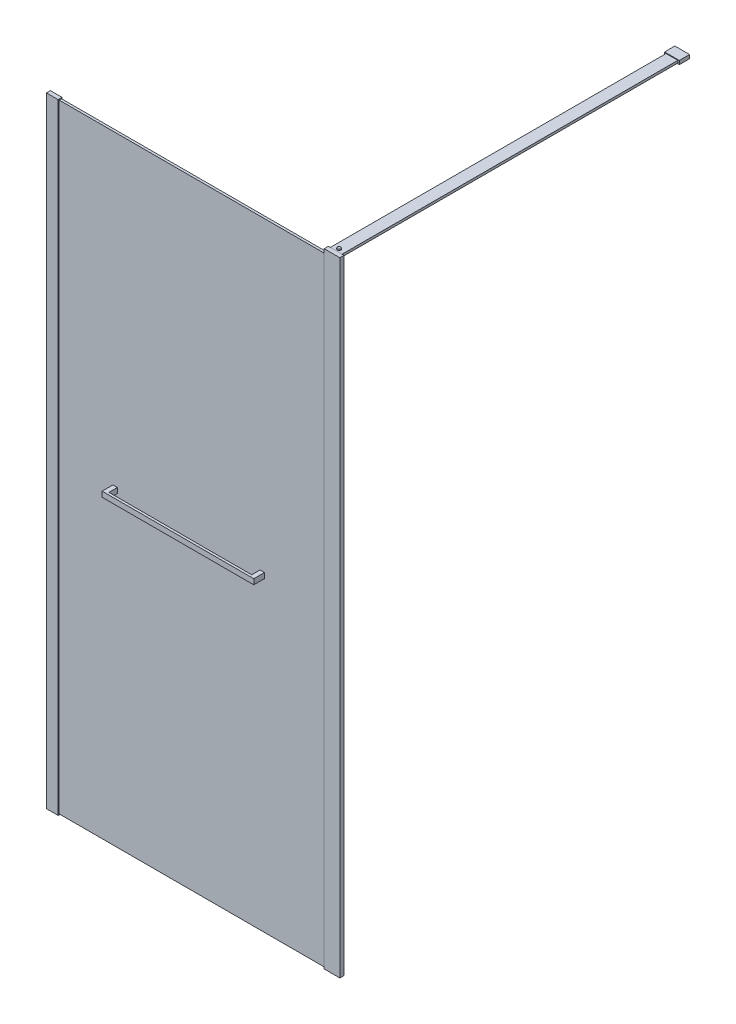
ISO-10303-21;
HEADER;
FILE_DESCRIPTION(('STEP AP214'),'2;1');
FILE_NAME('part.step','',(''),(''),'','','');
FILE_SCHEMA(('AUTOMOTIVE_DESIGN { 1 0 10303 214 1 1 1 1 }'));
ENDSEC;
DATA;
#1=APPLICATION_CONTEXT('core data for automotive mechanical design processes');
#2=APPLICATION_PROTOCOL_DEFINITION('international standard','automotive_design',2000,#1);
#3=PRODUCT_CONTEXT('',#1,'mechanical');
#4=PRODUCT('Part','Part','',(#3));
#5=PRODUCT_RELATED_PRODUCT_CATEGORY('part','',(#4));
#6=PRODUCT_DEFINITION_FORMATION('','',#4);
#7=PRODUCT_DEFINITION_CONTEXT('part definition',#1,'design');
#8=PRODUCT_DEFINITION('design','',#6,#7);
#9=PRODUCT_DEFINITION_SHAPE('','',#8);
#10=(LENGTH_UNIT() NAMED_UNIT(*) SI_UNIT(.MILLI.,.METRE.));
#11=(NAMED_UNIT(*) PLANE_ANGLE_UNIT() SI_UNIT($,.RADIAN.));
#12=(NAMED_UNIT(*) SI_UNIT($,.STERADIAN.) SOLID_ANGLE_UNIT());
#13=UNCERTAINTY_MEASURE_WITH_UNIT(LENGTH_MEASURE(1.E-05),#10,'distance_accuracy_value','');
#14=(GEOMETRIC_REPRESENTATION_CONTEXT(3) GLOBAL_UNCERTAINTY_ASSIGNED_CONTEXT((#13)) GLOBAL_UNIT_ASSIGNED_CONTEXT((#10,
#11,#12)) REPRESENTATION_CONTEXT('',''));
#15=CARTESIAN_POINT('',(0.,0.,0.));
#16=DIRECTION('',(0.,0.,1.));
#17=DIRECTION('',(1.,0.,0.));
#18=AXIS2_PLACEMENT_3D('',#15,#16,#17);
#19=CARTESIAN_POINT('',(237.5,1062.,-21.4));
#20=DIRECTION('',(1.,0.,0.));
#21=DIRECTION('',(0.,0.,-1.));
#22=AXIS2_PLACEMENT_3D('',#19,#20,#21);
#23=PLANE('',#22);
#24=DIRECTION('',(0.,1.,0.));
#25=VECTOR('',#24,1.);
#26=CARTESIAN_POINT('',(237.5,1062.,25.1));
#27=LINE('',#26,#25);
#28=CARTESIAN_POINT('',(237.5,1044.,25.1));
#29=VERTEX_POINT('',#28);
#30=CARTESIAN_POINT('',(237.5,1062.,25.1));
#31=VERTEX_POINT('',#30);
#32=EDGE_CURVE('E63',#29,#31,#27,.T.);
#33=ORIENTED_EDGE('',*,*,#32,.F.);
#34=DIRECTION('',(0.,0.,1.));
#35=VECTOR('',#34,1.);
#36=CARTESIAN_POINT('',(237.5,1044.,-21.4));
#37=LINE('',#36,#35);
#38=CARTESIAN_POINT('',(237.5,1044.,-21.4));
#39=VERTEX_POINT('',#38);
#40=EDGE_CURVE('E12',#39,#29,#37,.T.);
#41=ORIENTED_EDGE('',*,*,#40,.F.);
#42=DIRECTION('',(0.,1.,0.));
#43=VECTOR('',#42,1.);
#44=CARTESIAN_POINT('',(237.5,1062.,-21.4));
#45=LINE('',#44,#43);
#46=CARTESIAN_POINT('',(237.5,1062.,-21.4));
#47=VERTEX_POINT('',#46);
#48=EDGE_CURVE('E193',#39,#47,#45,.T.);
#49=ORIENTED_EDGE('',*,*,#48,.T.);
#50=DIRECTION('',(0.,0.,1.));
#51=VECTOR('',#50,1.);
#52=CARTESIAN_POINT('',(237.5,1062.,-21.4));
#53=LINE('',#52,#51);
#54=EDGE_CURVE('E176',#47,#31,#53,.T.);
#55=ORIENTED_EDGE('',*,*,#54,.T.);
#56=EDGE_LOOP('',(#33,#41,#49,#55));
#57=FACE_BOUND('',#56,.T.);
#58=ADVANCED_FACE('F46',(#57),#23,.T.);
#59=CARTESIAN_POINT('',(222.5,1044.,-21.4));
#60=DIRECTION('',(0.,-1.,0.));
#61=DIRECTION('',(0.,0.,-1.));
#62=AXIS2_PLACEMENT_3D('',#59,#60,#61);
#63=PLANE('',#62);
#64=ORIENTED_EDGE('',*,*,#40,.T.);
#65=DIRECTION('',(-1.,0.,0.));
#66=VECTOR('',#65,1.);
#67=CARTESIAN_POINT('',(742.197715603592,1044.,25.1));
#68=LINE('',#67,#66);
#69=CARTESIAN_POINT('',(722.5,1044.,25.1));
#70=VERTEX_POINT('',#69);
#71=EDGE_CURVE('E166',#70,#29,#68,.T.);
#72=ORIENTED_EDGE('',*,*,#71,.F.);
#73=DIRECTION('',(0.,0.,1.));
#74=VECTOR('',#73,1.);
#75=CARTESIAN_POINT('',(722.5,1044.,-21.4));
#76=LINE('',#75,#74);
#77=CARTESIAN_POINT('',(722.5,1044.,-21.4));
#78=VERTEX_POINT('',#77);
#79=EDGE_CURVE('E149',#78,#70,#76,.T.);
#80=ORIENTED_EDGE('',*,*,#79,.F.);
#81=DIRECTION('',(1.,0.,0.));
#82=VECTOR('',#81,1.);
#83=CARTESIAN_POINT('',(722.5,1044.,-21.4));
#84=LINE('',#83,#82);
#85=CARTESIAN_POINT('',(737.5,1044.,-21.4));
#86=VERTEX_POINT('',#85);
#87=EDGE_CURVE('E131',#78,#86,#84,.T.);
#88=ORIENTED_EDGE('',*,*,#87,.T.);
#89=DIRECTION('',(0.,0.,1.));
#90=VECTOR('',#89,1.);
#91=CARTESIAN_POINT('',(737.5,1044.,-21.4));
#92=LINE('',#91,#90);
#93=CARTESIAN_POINT('',(737.5,1044.,33.1));
#94=VERTEX_POINT('',#93);
#95=EDGE_CURVE('E147',#86,#94,#92,.T.);
#96=ORIENTED_EDGE('',*,*,#95,.T.);
#97=DIRECTION('',(1.,0.,0.));
#98=VECTOR('',#97,1.);
#99=CARTESIAN_POINT('',(222.5,1044.,33.1));
#100=LINE('',#99,#98);
#101=CARTESIAN_POINT('',(222.5,1044.,33.1));
#102=VERTEX_POINT('',#101);
#103=EDGE_CURVE('E135',#102,#94,#100,.T.);
#104=ORIENTED_EDGE('',*,*,#103,.F.);
#105=DIRECTION('',(0.,0.,1.));
#106=VECTOR('',#105,1.);
#107=CARTESIAN_POINT('',(222.5,1044.,-21.4));
#108=LINE('',#107,#106);
#109=CARTESIAN_POINT('',(222.5,1044.,-21.4));
#110=VERTEX_POINT('',#109);
#111=EDGE_CURVE('E55',#110,#102,#108,.T.);
#112=ORIENTED_EDGE('',*,*,#111,.F.);
#113=DIRECTION('',(1.,0.,0.));
#114=VECTOR('',#113,1.);
#115=CARTESIAN_POINT('',(222.5,1044.,-21.4));
#116=LINE('',#115,#114);
#117=EDGE_CURVE('E181',#110,#39,#116,.T.);
#118=ORIENTED_EDGE('',*,*,#117,.T.);
#119=EDGE_LOOP('',(#64,#72,#80,#88,#96,#104,#112,#118));
#120=FACE_BOUND('',#119,.T.);
#121=ADVANCED_FACE('F197',(#120),#63,.T.);
#122=CARTESIAN_POINT('',(222.5,1062.,-21.4));
#123=DIRECTION('',(-1.,0.,0.));
#124=DIRECTION('',(0.,0.,1.));
#125=AXIS2_PLACEMENT_3D('',#122,#123,#124);
#126=PLANE('',#125);
#127=ORIENTED_EDGE('',*,*,#111,.T.);
#128=DIRECTION('',(0.,-1.,0.));
#129=VECTOR('',#128,1.);
#130=CARTESIAN_POINT('',(222.5,1062.,33.1));
#131=LINE('',#130,#129);
#132=CARTESIAN_POINT('',(222.5,1062.,33.1));
#133=VERTEX_POINT('',#132);
#134=EDGE_CURVE('E121',#133,#102,#131,.T.);
#135=ORIENTED_EDGE('',*,*,#134,.F.);
#136=DIRECTION('',(0.,0.,1.));
#137=VECTOR('',#136,1.);
#138=CARTESIAN_POINT('',(222.5,1062.,-21.4));
#139=LINE('',#138,#137);
#140=CARTESIAN_POINT('',(222.5,1062.,-21.4));
#141=VERTEX_POINT('',#140);
#142=EDGE_CURVE('E116',#141,#133,#139,.T.);
#143=ORIENTED_EDGE('',*,*,#142,.F.);
#144=DIRECTION('',(0.,-1.,0.));
#145=VECTOR('',#144,1.);
#146=CARTESIAN_POINT('',(222.5,1062.,-21.4));
#147=LINE('',#146,#145);
#148=EDGE_CURVE('E186',#141,#110,#147,.T.);
#149=ORIENTED_EDGE('',*,*,#148,.T.);
#150=EDGE_LOOP('',(#127,#135,#143,#149));
#151=FACE_BOUND('',#150,.T.);
#152=ADVANCED_FACE('F218',(#151),#126,.T.);
#153=CARTESIAN_POINT('',(222.5,1062.,-21.4));
#154=DIRECTION('',(0.,1.,0.));
#155=DIRECTION('',(0.,0.,1.));
#156=AXIS2_PLACEMENT_3D('',#153,#154,#155);
#157=PLANE('',#156);
#158=ORIENTED_EDGE('',*,*,#142,.T.);
#159=DIRECTION('',(-1.,0.,0.));
#160=VECTOR('',#159,1.);
#161=CARTESIAN_POINT('',(222.5,1062.,33.1));
#162=LINE('',#161,#160);
#163=CARTESIAN_POINT('',(737.5,1062.,33.1));
#164=VERTEX_POINT('',#163);
#165=EDGE_CURVE('E109',#164,#133,#162,.T.);
#166=ORIENTED_EDGE('',*,*,#165,.F.);
#167=DIRECTION('',(0.,0.,1.));
#168=VECTOR('',#167,1.);
#169=CARTESIAN_POINT('',(737.5,1062.,-21.4));
#170=LINE('',#169,#168);
#171=CARTESIAN_POINT('',(737.5,1062.,-21.4));
#172=VERTEX_POINT('',#171);
#173=EDGE_CURVE('E113',#172,#164,#170,.T.);
#174=ORIENTED_EDGE('',*,*,#173,.F.);
#175=DIRECTION('',(-1.,0.,0.));
#176=VECTOR('',#175,1.);
#177=CARTESIAN_POINT('',(722.5,1062.,-21.4));
#178=LINE('',#177,#176);
#179=CARTESIAN_POINT('',(722.5,1062.,-21.4));
#180=VERTEX_POINT('',#179);
#181=EDGE_CURVE('E138',#172,#180,#178,.T.);
#182=ORIENTED_EDGE('',*,*,#181,.T.);
#183=DIRECTION('',(0.,0.,1.));
#184=VECTOR('',#183,1.);
#185=CARTESIAN_POINT('',(722.5,1062.,-21.4));
#186=LINE('',#185,#184);
#187=CARTESIAN_POINT('',(722.5,1062.,25.1));
#188=VERTEX_POINT('',#187);
#189=EDGE_CURVE('E130',#180,#188,#186,.T.);
#190=ORIENTED_EDGE('',*,*,#189,.T.);
#191=DIRECTION('',(-1.,0.,0.));
#192=VECTOR('',#191,1.);
#193=CARTESIAN_POINT('',(742.197715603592,1062.,25.1));
#194=LINE('',#193,#192);
#195=EDGE_CURVE('E163',#188,#31,#194,.T.);
#196=ORIENTED_EDGE('',*,*,#195,.T.);
#197=ORIENTED_EDGE('',*,*,#54,.F.);
#198=DIRECTION('',(-1.,0.,0.));
#199=VECTOR('',#198,1.);
#200=CARTESIAN_POINT('',(222.5,1062.,-21.4));
#201=LINE('',#200,#199);
#202=EDGE_CURVE('E190',#47,#141,#201,.T.);
#203=ORIENTED_EDGE('',*,*,#202,.T.);
#204=EDGE_LOOP('',(#158,#166,#174,#182,#190,#196,#197,#203));
#205=FACE_BOUND('',#204,.T.);
#206=ADVANCED_FACE('F111',(#205),#157,.T.);
#207=CARTESIAN_POINT('',(237.5,1044.,-21.4));
#208=DIRECTION('',(0.,0.,1.));
#209=DIRECTION('',(1.,0.,0.));
#210=AXIS2_PLACEMENT_3D('',#207,#208,#209);
#211=PLANE('',#210);
#212=ORIENTED_EDGE('',*,*,#48,.F.);
#213=ORIENTED_EDGE('',*,*,#117,.F.);
#214=ORIENTED_EDGE('',*,*,#148,.F.);
#215=ORIENTED_EDGE('',*,*,#202,.F.);
#216=EDGE_LOOP('',(#212,#213,#214,#215));
#217=FACE_BOUND('',#216,.T.);
#218=ADVANCED_FACE('F225',(#217),#211,.F.);
#219=CARTESIAN_POINT('',(237.5,1044.,33.1));
#220=DIRECTION('',(0.,0.,1.));
#221=DIRECTION('',(1.,0.,0.));
#222=AXIS2_PLACEMENT_3D('',#219,#220,#221);
#223=PLANE('',#222);
#224=ORIENTED_EDGE('',*,*,#103,.T.);
#225=DIRECTION('',(0.,1.,0.));
#226=VECTOR('',#225,1.);
#227=CARTESIAN_POINT('',(737.5,1062.,33.1));
#228=LINE('',#227,#226);
#229=EDGE_CURVE('E127',#94,#164,#228,.T.);
#230=ORIENTED_EDGE('',*,*,#229,.T.);
#231=ORIENTED_EDGE('',*,*,#165,.T.);
#232=ORIENTED_EDGE('',*,*,#134,.T.);
#233=EDGE_LOOP('',(#224,#230,#231,#232));
#234=FACE_BOUND('',#233,.T.);
#235=ADVANCED_FACE('F133',(#234),#223,.T.);
#236=CARTESIAN_POINT('',(742.197715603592,1062.,25.1));
#237=DIRECTION('',(0.,0.,1.));
#238=DIRECTION('',(1.,0.,0.));
#239=AXIS2_PLACEMENT_3D('',#236,#237,#238);
#240=PLANE('',#239);
#241=ORIENTED_EDGE('',*,*,#195,.F.);
#242=DIRECTION('',(0.,-1.,0.));
#243=VECTOR('',#242,1.);
#244=CARTESIAN_POINT('',(722.5,1062.,25.1));
#245=LINE('',#244,#243);
#246=EDGE_CURVE('E49',#188,#70,#245,.T.);
#247=ORIENTED_EDGE('',*,*,#246,.T.);
#248=ORIENTED_EDGE('',*,*,#71,.T.);
#249=ORIENTED_EDGE('',*,*,#32,.T.);
#250=EDGE_LOOP('',(#241,#247,#248,#249));
#251=FACE_BOUND('',#250,.T.);
#252=ADVANCED_FACE('F203',(#251),#240,.F.);
#253=CARTESIAN_POINT('',(722.5,1062.,-21.4));
#254=DIRECTION('',(-1.,0.,0.));
#255=DIRECTION('',(0.,0.,1.));
#256=AXIS2_PLACEMENT_3D('',#253,#254,#255);
#257=PLANE('',#256);
#258=ORIENTED_EDGE('',*,*,#246,.F.);
#259=ORIENTED_EDGE('',*,*,#189,.F.);
#260=DIRECTION('',(0.,-1.,0.));
#261=VECTOR('',#260,1.);
#262=CARTESIAN_POINT('',(722.5,1062.,-21.4));
#263=LINE('',#262,#261);
#264=EDGE_CURVE('E142',#180,#78,#263,.T.);
#265=ORIENTED_EDGE('',*,*,#264,.T.);
#266=ORIENTED_EDGE('',*,*,#79,.T.);
#267=EDGE_LOOP('',(#258,#259,#265,#266));
#268=FACE_BOUND('',#267,.T.);
#269=ADVANCED_FACE('F204',(#268),#257,.T.);
#270=CARTESIAN_POINT('',(737.5,1062.,-21.4));
#271=DIRECTION('',(1.,0.,0.));
#272=DIRECTION('',(0.,0.,-1.));
#273=AXIS2_PLACEMENT_3D('',#270,#271,#272);
#274=PLANE('',#273);
#275=ORIENTED_EDGE('',*,*,#173,.T.);
#276=ORIENTED_EDGE('',*,*,#229,.F.);
#277=ORIENTED_EDGE('',*,*,#95,.F.);
#278=DIRECTION('',(0.,1.,0.));
#279=VECTOR('',#278,1.);
#280=CARTESIAN_POINT('',(737.5,1062.,-21.4));
#281=LINE('',#280,#279);
#282=EDGE_CURVE('E129',#86,#172,#281,.T.);
#283=ORIENTED_EDGE('',*,*,#282,.T.);
#284=EDGE_LOOP('',(#275,#276,#277,#283));
#285=FACE_BOUND('',#284,.T.);
#286=ADVANCED_FACE('F126',(#285),#274,.T.);
#287=CARTESIAN_POINT('',(737.5,1044.,-21.4));
#288=DIRECTION('',(0.,0.,1.));
#289=DIRECTION('',(1.,0.,0.));
#290=AXIS2_PLACEMENT_3D('',#287,#288,#289);
#291=PLANE('',#290);
#292=ORIENTED_EDGE('',*,*,#282,.F.);
#293=ORIENTED_EDGE('',*,*,#87,.F.);
#294=ORIENTED_EDGE('',*,*,#264,.F.);
#295=ORIENTED_EDGE('',*,*,#181,.F.);
#296=EDGE_LOOP('',(#292,#293,#294,#295));
#297=FACE_BOUND('',#296,.T.);
#298=ADVANCED_FACE('F200',(#297),#291,.F.);
#299=CLOSED_SHELL('',(#58,#121,#152,#206,#218,#235,#252,#269,#286,#298));
#300=MANIFOLD_SOLID_BREP('B2',#299);
#301=CARTESIAN_POINT('',(989.9,2119.,-1184.4));
#302=DIRECTION('',(-1.,0.,0.));
#303=DIRECTION('',(0.,0.,1.));
#304=AXIS2_PLACEMENT_3D('',#301,#302,#303);
#305=PLANE('',#304);
#306=DIRECTION('',(0.,-1.,0.));
#307=VECTOR('',#306,1.);
#308=CARTESIAN_POINT('',(989.9,2119.,-1155.));
#309=LINE('',#308,#307);
#310=CARTESIAN_POINT('',(989.9,2119.,-1155.));
#311=VERTEX_POINT('',#310);
#312=CARTESIAN_POINT('',(989.9,2111.,-1155.));
#313=VERTEX_POINT('',#312);
#314=EDGE_CURVE('E417',#311,#313,#309,.T.);
#315=ORIENTED_EDGE('',*,*,#314,.F.);
#316=DIRECTION('',(0.,0.,1.));
#317=VECTOR('',#316,1.);
#318=CARTESIAN_POINT('',(989.9,2119.,-1184.4));
#319=LINE('',#318,#317);
#320=CARTESIAN_POINT('',(989.9,2119.,-14.4));
#321=VERTEX_POINT('',#320);
#322=EDGE_CURVE('E432',#311,#321,#319,.T.);
#323=ORIENTED_EDGE('',*,*,#322,.T.);
#324=DIRECTION('',(0.,-1.,0.));
#325=VECTOR('',#324,1.);
#326=CARTESIAN_POINT('',(989.9,2119.,-14.4));
#327=LINE('',#326,#325);
#328=CARTESIAN_POINT('',(989.9,2111.,-14.4));
#329=VERTEX_POINT('',#328);
#330=EDGE_CURVE('E420',#321,#329,#327,.T.);
#331=ORIENTED_EDGE('',*,*,#330,.T.);
#332=DIRECTION('',(0.,0.,1.));
#333=VECTOR('',#332,1.);
#334=CARTESIAN_POINT('',(989.9,2111.,-1184.4));
#335=LINE('',#334,#333);
#336=EDGE_CURVE('E327',#313,#329,#335,.T.);
#337=ORIENTED_EDGE('',*,*,#336,.F.);
#338=EDGE_LOOP('',(#315,#323,#331,#337));
#339=FACE_BOUND('',#338,.T.);
#340=ADVANCED_FACE('F319',(#339),#305,.F.);
#341=CARTESIAN_POINT('',(989.9,2111.,-1184.4));
#342=DIRECTION('',(0.,1.,0.));
#343=DIRECTION('',(0.,0.,1.));
#344=AXIS2_PLACEMENT_3D('',#341,#342,#343);
#345=PLANE('',#344);
#346=DIRECTION('',(-1.,0.,0.));
#347=VECTOR('',#346,1.);
#348=CARTESIAN_POINT('',(989.9,2111.,-1155.));
#349=LINE('',#348,#347);
#350=CARTESIAN_POINT('',(949.9,2111.,-1155.));
#351=VERTEX_POINT('',#350);
#352=EDGE_CURVE('E334',#313,#351,#349,.T.);
#353=ORIENTED_EDGE('',*,*,#352,.F.);
#354=ORIENTED_EDGE('',*,*,#336,.T.);
#355=DIRECTION('',(-1.,0.,0.));
#356=VECTOR('',#355,1.);
#357=CARTESIAN_POINT('',(989.9,2111.,-14.4));
#358=LINE('',#357,#356);
#359=CARTESIAN_POINT('',(949.9,2111.,-14.4));
#360=VERTEX_POINT('',#359);
#361=EDGE_CURVE('E423',#329,#360,#358,.T.);
#362=ORIENTED_EDGE('',*,*,#361,.T.);
#363=DIRECTION('',(0.,0.,1.));
#364=VECTOR('',#363,1.);
#365=CARTESIAN_POINT('',(949.9,2111.,-1184.4));
#366=LINE('',#365,#364);
#367=EDGE_CURVE('E436',#351,#360,#366,.T.);
#368=ORIENTED_EDGE('',*,*,#367,.F.);
#369=EDGE_LOOP('',(#353,#354,#362,#368));
#370=FACE_BOUND('',#369,.T.);
#371=ADVANCED_FACE('F438',(#370),#345,.F.);
#372=CARTESIAN_POINT('',(949.9,2119.,-1184.4));
#373=DIRECTION('',(1.,0.,0.));
#374=DIRECTION('',(0.,0.,-1.));
#375=AXIS2_PLACEMENT_3D('',#372,#373,#374);
#376=PLANE('',#375);
#377=DIRECTION('',(0.,1.,0.));
#378=VECTOR('',#377,1.);
#379=CARTESIAN_POINT('',(949.9,2119.,-1155.));
#380=LINE('',#379,#378);
#381=CARTESIAN_POINT('',(949.9,2119.,-1155.));
#382=VERTEX_POINT('',#381);
#383=EDGE_CURVE('E342',#351,#382,#380,.T.);
#384=ORIENTED_EDGE('',*,*,#383,.F.);
#385=ORIENTED_EDGE('',*,*,#367,.T.);
#386=DIRECTION('',(0.,1.,0.));
#387=VECTOR('',#386,1.);
#388=CARTESIAN_POINT('',(949.9,2119.,-14.4));
#389=LINE('',#388,#387);
#390=CARTESIAN_POINT('',(949.9,2119.,-14.4));
#391=VERTEX_POINT('',#390);
#392=EDGE_CURVE('E426',#360,#391,#389,.T.);
#393=ORIENTED_EDGE('',*,*,#392,.T.);
#394=DIRECTION('',(0.,0.,1.));
#395=VECTOR('',#394,1.);
#396=CARTESIAN_POINT('',(949.9,2119.,-1184.4));
#397=LINE('',#396,#395);
#398=EDGE_CURVE('E434',#382,#391,#397,.T.);
#399=ORIENTED_EDGE('',*,*,#398,.F.);
#400=EDGE_LOOP('',(#384,#385,#393,#399));
#401=FACE_BOUND('',#400,.T.);
#402=ADVANCED_FACE('F448',(#401),#376,.F.);
#403=CARTESIAN_POINT('',(989.9,2119.,-1184.4));
#404=DIRECTION('',(0.,-1.,0.));
#405=DIRECTION('',(0.,0.,-1.));
#406=AXIS2_PLACEMENT_3D('',#403,#404,#405);
#407=PLANE('',#406);
#408=CARTESIAN_POINT('',(969.9,2119.,-24.3999999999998));
#409=DIRECTION('',(0.,-1.,0.));
#410=DIRECTION('',(0.,0.,-1.));
#411=AXIS2_PLACEMENT_3D('',#408,#409,#410);
#412=CIRCLE('',#411,5.90000000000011);
#413=CARTESIAN_POINT('',(969.9,2119.,-30.3));
#414=VERTEX_POINT('',#413);
#415=EDGE_CURVE('E511',#414,#414,#412,.T.);
#416=ORIENTED_EDGE('',*,*,#415,.T.);
#417=EDGE_LOOP('',(#416));
#418=FACE_BOUND('',#417,.T.);
#419=DIRECTION('',(1.,0.,0.));
#420=VECTOR('',#419,1.);
#421=CARTESIAN_POINT('',(989.9,2119.,-1155.));
#422=LINE('',#421,#420);
#423=EDGE_CURVE('E44',#382,#311,#422,.T.);
#424=ORIENTED_EDGE('',*,*,#423,.F.);
#425=ORIENTED_EDGE('',*,*,#398,.T.);
#426=DIRECTION('',(1.,0.,0.));
#427=VECTOR('',#426,1.);
#428=CARTESIAN_POINT('',(989.9,2119.,-14.4));
#429=LINE('',#428,#427);
#430=EDGE_CURVE('E429',#391,#321,#429,.T.);
#431=ORIENTED_EDGE('',*,*,#430,.T.);
#432=ORIENTED_EDGE('',*,*,#322,.F.);
#433=EDGE_LOOP('',(#424,#425,#431,#432));
#434=FACE_BOUND('',#433,.T.);
#435=ADVANCED_FACE('F447',(#418,#434),#407,.F.);
#436=CARTESIAN_POINT('',(989.9,2111.,-14.4));
#437=DIRECTION('',(0.,0.,-1.));
#438=DIRECTION('',(-1.,0.,0.));
#439=AXIS2_PLACEMENT_3D('',#436,#437,#438);
#440=PLANE('',#439);
#441=ORIENTED_EDGE('',*,*,#330,.F.);
#442=ORIENTED_EDGE('',*,*,#430,.F.);
#443=ORIENTED_EDGE('',*,*,#392,.F.);
#444=ORIENTED_EDGE('',*,*,#361,.F.);
#445=EDGE_LOOP('',(#441,#442,#443,#444));
#446=FACE_BOUND('',#445,.T.);
#447=ADVANCED_FACE('F444',(#446),#440,.F.);
#448=CARTESIAN_POINT('',(944.9,2108.75,-1155.));
#449=DIRECTION('',(0.,0.,-1.));
#450=DIRECTION('',(-1.,0.,0.));
#451=AXIS2_PLACEMENT_3D('',#448,#449,#450);
#452=PLANE('',#451);
#453=DIRECTION('',(0.,1.,0.));
#454=VECTOR('',#453,1.);
#455=CARTESIAN_POINT('',(944.9,2121.25,-1155.));
#456=LINE('',#455,#454);
#457=CARTESIAN_POINT('',(944.9,2108.75,-1155.));
#458=VERTEX_POINT('',#457);
#459=CARTESIAN_POINT('',(944.9,2121.25,-1155.));
#460=VERTEX_POINT('',#459);
#461=EDGE_CURVE('E409',#458,#460,#456,.T.);
#462=ORIENTED_EDGE('',*,*,#461,.F.);
#463=DIRECTION('',(-1.,0.,0.));
#464=VECTOR('',#463,1.);
#465=CARTESIAN_POINT('',(994.9,2108.75,-1155.));
#466=LINE('',#465,#464);
#467=CARTESIAN_POINT('',(994.9,2108.75,-1155.));
#468=VERTEX_POINT('',#467);
#469=EDGE_CURVE('E405',#468,#458,#466,.T.);
#470=ORIENTED_EDGE('',*,*,#469,.F.);
#471=DIRECTION('',(0.,-1.,0.));
#472=VECTOR('',#471,1.);
#473=CARTESIAN_POINT('',(994.9,2121.25,-1155.));
#474=LINE('',#473,#472);
#475=CARTESIAN_POINT('',(994.9,2121.25,-1155.));
#476=VERTEX_POINT('',#475);
#477=EDGE_CURVE('E492',#476,#468,#474,.T.);
#478=ORIENTED_EDGE('',*,*,#477,.F.);
#479=DIRECTION('',(1.,0.,0.));
#480=VECTOR('',#479,1.);
#481=CARTESIAN_POINT('',(994.9,2121.25,-1155.));
#482=LINE('',#481,#480);
#483=EDGE_CURVE('E495',#460,#476,#482,.T.);
#484=ORIENTED_EDGE('',*,*,#483,.F.);
#485=EDGE_LOOP('',(#462,#470,#478,#484));
#486=FACE_BOUND('',#485,.T.);
#487=ORIENTED_EDGE('',*,*,#423,.T.);
#488=ORIENTED_EDGE('',*,*,#314,.T.);
#489=ORIENTED_EDGE('',*,*,#352,.T.);
#490=ORIENTED_EDGE('',*,*,#383,.T.);
#491=EDGE_LOOP('',(#487,#488,#489,#490));
#492=FACE_BOUND('',#491,.T.);
#493=ADVANCED_FACE('F450',(#486,#492),#452,.F.);
#494=CARTESIAN_POINT('',(944.9,2121.25,-1190.));
#495=DIRECTION('',(1.,0.,0.));
#496=DIRECTION('',(0.,0.,-1.));
#497=AXIS2_PLACEMENT_3D('',#494,#495,#496);
#498=PLANE('',#497);
#499=ORIENTED_EDGE('',*,*,#461,.T.);
#500=DIRECTION('',(0.,0.,1.));
#501=VECTOR('',#500,1.);
#502=CARTESIAN_POINT('',(944.9,2121.25,-1190.));
#503=LINE('',#502,#501);
#504=CARTESIAN_POINT('',(944.9,2121.25,-1190.));
#505=VERTEX_POINT('',#504);
#506=EDGE_CURVE('E389',#505,#460,#503,.T.);
#507=ORIENTED_EDGE('',*,*,#506,.F.);
#508=DIRECTION('',(0.,1.,0.));
#509=VECTOR('',#508,1.);
#510=CARTESIAN_POINT('',(944.9,2121.25,-1190.));
#511=LINE('',#510,#509);
#512=CARTESIAN_POINT('',(944.9,2108.75,-1190.));
#513=VERTEX_POINT('',#512);
#514=EDGE_CURVE('E396',#513,#505,#511,.T.);
#515=ORIENTED_EDGE('',*,*,#514,.F.);
#516=DIRECTION('',(0.,0.,1.));
#517=VECTOR('',#516,1.);
#518=CARTESIAN_POINT('',(944.9,2108.75,-1190.));
#519=LINE('',#518,#517);
#520=EDGE_CURVE('E489',#513,#458,#519,.T.);
#521=ORIENTED_EDGE('',*,*,#520,.T.);
#522=EDGE_LOOP('',(#499,#507,#515,#521));
#523=FACE_BOUND('',#522,.T.);
#524=ADVANCED_FACE('F407',(#523),#498,.F.);
#525=CARTESIAN_POINT('',(994.9,2121.25,-1190.));
#526=DIRECTION('',(0.,-1.,0.));
#527=DIRECTION('',(0.,0.,-1.));
#528=AXIS2_PLACEMENT_3D('',#525,#526,#527);
#529=PLANE('',#528);
#530=ORIENTED_EDGE('',*,*,#483,.T.);
#531=DIRECTION('',(0.,0.,1.));
#532=VECTOR('',#531,1.);
#533=CARTESIAN_POINT('',(994.9,2121.25,-1190.));
#534=LINE('',#533,#532);
#535=CARTESIAN_POINT('',(994.9,2121.25,-1190.));
#536=VERTEX_POINT('',#535);
#537=EDGE_CURVE('E392',#536,#476,#534,.T.);
#538=ORIENTED_EDGE('',*,*,#537,.F.);
#539=DIRECTION('',(1.,0.,0.));
#540=VECTOR('',#539,1.);
#541=CARTESIAN_POINT('',(994.9,2121.25,-1190.));
#542=LINE('',#541,#540);
#543=EDGE_CURVE('E385',#505,#536,#542,.T.);
#544=ORIENTED_EDGE('',*,*,#543,.F.);
#545=ORIENTED_EDGE('',*,*,#506,.T.);
#546=EDGE_LOOP('',(#530,#538,#544,#545));
#547=FACE_BOUND('',#546,.T.);
#548=ADVANCED_FACE('F387',(#547),#529,.F.);
#549=CARTESIAN_POINT('',(994.9,2121.25,-1190.));
#550=DIRECTION('',(-1.,0.,0.));
#551=DIRECTION('',(0.,0.,1.));
#552=AXIS2_PLACEMENT_3D('',#549,#550,#551);
#553=PLANE('',#552);
#554=ORIENTED_EDGE('',*,*,#477,.T.);
#555=DIRECTION('',(0.,0.,1.));
#556=VECTOR('',#555,1.);
#557=CARTESIAN_POINT('',(994.9,2108.75,-1190.));
#558=LINE('',#557,#556);
#559=CARTESIAN_POINT('',(994.9,2108.75,-1190.));
#560=VERTEX_POINT('',#559);
#561=EDGE_CURVE('E412',#560,#468,#558,.T.);
#562=ORIENTED_EDGE('',*,*,#561,.F.);
#563=DIRECTION('',(0.,-1.,0.));
#564=VECTOR('',#563,1.);
#565=CARTESIAN_POINT('',(994.9,2121.25,-1190.));
#566=LINE('',#565,#564);
#567=EDGE_CURVE('E395',#536,#560,#566,.T.);
#568=ORIENTED_EDGE('',*,*,#567,.F.);
#569=ORIENTED_EDGE('',*,*,#537,.T.);
#570=EDGE_LOOP('',(#554,#562,#568,#569));
#571=FACE_BOUND('',#570,.T.);
#572=ADVANCED_FACE('F477',(#571),#553,.F.);
#573=CARTESIAN_POINT('',(994.9,2108.75,-1190.));
#574=DIRECTION('',(0.,1.,0.));
#575=DIRECTION('',(0.,0.,1.));
#576=AXIS2_PLACEMENT_3D('',#573,#574,#575);
#577=PLANE('',#576);
#578=ORIENTED_EDGE('',*,*,#469,.T.);
#579=ORIENTED_EDGE('',*,*,#520,.F.);
#580=DIRECTION('',(-1.,0.,0.));
#581=VECTOR('',#580,1.);
#582=CARTESIAN_POINT('',(994.9,2108.75,-1190.));
#583=LINE('',#582,#581);
#584=EDGE_CURVE('E401',#560,#513,#583,.T.);
#585=ORIENTED_EDGE('',*,*,#584,.F.);
#586=ORIENTED_EDGE('',*,*,#561,.T.);
#587=EDGE_LOOP('',(#578,#579,#585,#586));
#588=FACE_BOUND('',#587,.T.);
#589=ADVANCED_FACE('F479',(#588),#577,.F.);
#590=CARTESIAN_POINT('',(944.9,2108.75,-1190.));
#591=DIRECTION('',(0.,0.,-1.));
#592=DIRECTION('',(-1.,0.,0.));
#593=AXIS2_PLACEMENT_3D('',#590,#591,#592);
#594=PLANE('',#593);
#595=ORIENTED_EDGE('',*,*,#514,.T.);
#596=ORIENTED_EDGE('',*,*,#543,.T.);
#597=ORIENTED_EDGE('',*,*,#567,.T.);
#598=ORIENTED_EDGE('',*,*,#584,.T.);
#599=EDGE_LOOP('',(#595,#596,#597,#598));
#600=FACE_BOUND('',#599,.T.);
#601=ADVANCED_FACE('F399',(#600),#594,.T.);
#602=CARTESIAN_POINT('',(969.9,2115.34934210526,-24.4));
#603=DIRECTION('',(0.,-1.,0.));
#604=DIRECTION('',(0.,0.,-1.));
#605=AXIS2_PLACEMENT_3D('',#602,#603,#604);
#606=SPHERICAL_SURFACE('',#605,9.35065789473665);
#607=CARTESIAN_POINT('',(969.9,2122.8,-24.3999999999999));
#608=DIRECTION('',(0.,-1.,0.));
#609=DIRECTION('',(0.,0.,-1.));
#610=AXIS2_PLACEMENT_3D('',#607,#608,#609);
#611=CIRCLE('',#610,5.65000000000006);
#612=CARTESIAN_POINT('',(969.9,2122.8,-30.05));
#613=VERTEX_POINT('',#612);
#614=EDGE_CURVE('E508',#613,#613,#611,.T.);
#615=ORIENTED_EDGE('',*,*,#614,.F.);
#616=EDGE_LOOP('',(#615));
#617=FACE_BOUND('',#616,.T.);
#618=ADVANCED_FACE('F486',(#617),#606,.T.);
#619=CARTESIAN_POINT('',(969.9,2119.,-24.3999999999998));
#620=DIRECTION('',(0.,-1.,0.));
#621=DIRECTION('',(0.,0.,-1.));
#622=AXIS2_PLACEMENT_3D('',#619,#620,#621);
#623=CONICAL_SURFACE('',#622,5.90000000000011,0.0656948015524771);
#624=ORIENTED_EDGE('',*,*,#614,.T.);
#625=EDGE_LOOP('',(#624));
#626=FACE_BOUND('',#625,.T.);
#627=ORIENTED_EDGE('',*,*,#415,.F.);
#628=EDGE_LOOP('',(#627));
#629=FACE_BOUND('',#628,.T.);
#630=ADVANCED_FACE('F515',(#626,#629),#623,.T.);
#631=CLOSED_SHELL('',(#340,#371,#402,#435,#447,#493,#524,#548,#572,#589,#601,#618,#630));
#632=CARTESIAN_POINT('',(969.9,2122.53567623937,-24.3999999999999));
#633=DIRECTION('',(0.,-1.,0.));
#634=DIRECTION('',(0.,0.,-1.));
#635=AXIS2_PLACEMENT_3D('',#632,#633,#634);
#636=CONICAL_SURFACE('',#635,5.1663088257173,0.0656948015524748);
#637=CARTESIAN_POINT('',(969.9,2119.,-24.3999999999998));
#638=DIRECTION('',(0.,-1.,0.));
#639=DIRECTION('',(0.,0.,-1.));
#640=AXIS2_PLACEMENT_3D('',#637,#638,#639);
#641=CIRCLE('',#640,5.398919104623);
#642=CARTESIAN_POINT('',(969.9,2119.,-29.7989191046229));
#643=VERTEX_POINT('',#642);
#644=EDGE_CURVE('E496',#643,#643,#641,.T.);
#645=ORIENTED_EDGE('',*,*,#644,.T.);
#646=EDGE_LOOP('',(#645));
#647=FACE_BOUND('',#646,.T.);
#648=CARTESIAN_POINT('',(969.9,2122.53567623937,-24.3999999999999));
#649=DIRECTION('',(0.,-1.,0.));
#650=DIRECTION('',(0.,0.,-1.));
#651=AXIS2_PLACEMENT_3D('',#648,#649,#650);
#652=CIRCLE('',#651,5.1663088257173);
#653=CARTESIAN_POINT('',(969.9,2122.53567623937,-29.5663088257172));
#654=VERTEX_POINT('',#653);
#655=EDGE_CURVE('E500',#654,#654,#652,.T.);
#656=ORIENTED_EDGE('',*,*,#655,.F.);
#657=EDGE_LOOP('',(#656));
#658=FACE_BOUND('',#657,.T.);
#659=ADVANCED_FACE('F529',(#647,#658),#636,.F.);
#660=CARTESIAN_POINT('',(969.9,2115.34934210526,-24.4));
#661=DIRECTION('',(0.,-1.,0.));
#662=DIRECTION('',(0.,0.,1.));
#663=AXIS2_PLACEMENT_3D('',#660,#661,#662);
#664=SPHERICAL_SURFACE('',#663,8.85065789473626);
#665=ORIENTED_EDGE('',*,*,#655,.T.);
#666=EDGE_LOOP('',(#665));
#667=FACE_BOUND('',#666,.T.);
#668=ADVANCED_FACE('F526',(#667),#664,.F.);
#669=ORIENTED_EDGE('',*,*,#644,.F.);
#670=EDGE_LOOP('',(#669));
#671=FACE_BOUND('',#670,.T.);
#672=ADVANCED_FACE('F473',(#671),#407,.F.);
#673=CLOSED_SHELL('',(#659,#668,#672));
#674=ORIENTED_CLOSED_SHELL('',*,#673,.T.);
#675=BREP_WITH_VOIDS('B6',#631,(#674));
#676=CARTESIAN_POINT('',(996.4,2111.,-0.399999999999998));
#677=DIRECTION('',(0.,-1.,0.));
#678=DIRECTION('',(0.,0.,-1.));
#679=AXIS2_PLACEMENT_3D('',#676,#677,#678);
#680=PLANE('',#679);
#681=DIRECTION('',(-1.,0.,0.));
#682=VECTOR('',#681,1.);
#683=CARTESIAN_POINT('',(943.4,2111.,-11.4));
#684=LINE('',#683,#682);
#685=CARTESIAN_POINT('',(944.7,2111.,-11.4));
#686=VERTEX_POINT('',#685);
#687=CARTESIAN_POINT('',(943.4,2111.,-11.4));
#688=VERTEX_POINT('',#687);
#689=EDGE_CURVE('E781',#686,#688,#684,.T.);
#690=ORIENTED_EDGE('',*,*,#689,.F.);
#691=DIRECTION('',(0.,0.,1.));
#692=VECTOR('',#691,1.);
#693=CARTESIAN_POINT('',(944.7,2111.,-0.399999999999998));
#694=LINE('',#693,#692);
#695=CARTESIAN_POINT('',(944.7,2111.,-3.39999999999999));
#696=VERTEX_POINT('',#695);
#697=EDGE_CURVE('E647',#686,#696,#694,.T.);
#698=ORIENTED_EDGE('',*,*,#697,.T.);
#699=DIRECTION('',(1.,0.,0.));
#700=VECTOR('',#699,1.);
#701=CARTESIAN_POINT('',(953.5,2111.,-3.39999999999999));
#702=LINE('',#701,#700);
#703=CARTESIAN_POINT('',(943.4,2111.,-3.39999999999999));
#704=VERTEX_POINT('',#703);
#705=EDGE_CURVE('E785',#704,#696,#702,.T.);
#706=ORIENTED_EDGE('',*,*,#705,.F.);
#707=DIRECTION('',(0.,0.,1.));
#708=VECTOR('',#707,1.);
#709=CARTESIAN_POINT('',(943.4,2111.,-14.4));
#710=LINE('',#709,#708);
#711=EDGE_CURVE('E762',#688,#704,#710,.T.);
#712=ORIENTED_EDGE('',*,*,#711,.F.);
#713=EDGE_LOOP('',(#690,#698,#706,#712));
#714=FACE_BOUND('',#713,.T.);
#715=ADVANCED_FACE('F638',(#714),#680,.T.);
#716=CARTESIAN_POINT('',(953.5,2111.,-3.39999999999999));
#717=DIRECTION('',(0.,0.,-1.));
#718=DIRECTION('',(-1.,0.,0.));
#719=AXIS2_PLACEMENT_3D('',#716,#717,#718);
#720=PLANE('',#719);
#721=DIRECTION('',(-1.,0.,0.));
#722=VECTOR('',#721,1.);
#723=CARTESIAN_POINT('',(953.5,2103.2,-3.39999999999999));
#724=LINE('',#723,#722);
#725=CARTESIAN_POINT('',(953.5,2103.2,-3.39999999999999));
#726=VERTEX_POINT('',#725);
#727=CARTESIAN_POINT('',(944.7,2103.2,-3.39999999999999));
#728=VERTEX_POINT('',#727);
#729=EDGE_CURVE('E760',#726,#728,#724,.T.);
#730=ORIENTED_EDGE('',*,*,#729,.F.);
#731=DIRECTION('',(0.,-1.,0.));
#732=VECTOR('',#731,1.);
#733=CARTESIAN_POINT('',(953.5,2111.,-3.39999999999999));
#734=LINE('',#733,#732);
#735=CARTESIAN_POINT('',(953.5,3.,-3.39999999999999));
#736=VERTEX_POINT('',#735);
#737=EDGE_CURVE('E784',#726,#736,#734,.T.);
#738=ORIENTED_EDGE('',*,*,#737,.T.);
#739=DIRECTION('',(1.,0.,0.));
#740=VECTOR('',#739,1.);
#741=CARTESIAN_POINT('',(953.5,3.,-3.39999999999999));
#742=LINE('',#741,#740);
#743=CARTESIAN_POINT('',(943.4,3.,-3.39999999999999));
#744=VERTEX_POINT('',#743);
#745=EDGE_CURVE('E772',#744,#736,#742,.T.);
#746=ORIENTED_EDGE('',*,*,#745,.F.);
#747=DIRECTION('',(0.,-1.,0.));
#748=VECTOR('',#747,1.);
#749=CARTESIAN_POINT('',(943.4,2111.,-3.39999999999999));
#750=LINE('',#749,#748);
#751=EDGE_CURVE('E663',#704,#744,#750,.T.);
#752=ORIENTED_EDGE('',*,*,#751,.F.);
#753=ORIENTED_EDGE('',*,*,#705,.T.);
#754=DIRECTION('',(0.,-1.,0.));
#755=VECTOR('',#754,1.);
#756=CARTESIAN_POINT('',(944.7,2111.,-3.39999999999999));
#757=LINE('',#756,#755);
#758=EDGE_CURVE('E655',#696,#728,#757,.T.);
#759=ORIENTED_EDGE('',*,*,#758,.T.);
#760=EDGE_LOOP('',(#730,#738,#746,#752,#753,#759));
#761=FACE_BOUND('',#760,.T.);
#762=ADVANCED_FACE('F640',(#761),#720,.T.);
#763=CARTESIAN_POINT('',(943.4,2111.,-3.39999999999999));
#764=DIRECTION('',(-1.,0.,0.));
#765=DIRECTION('',(0.,0.,1.));
#766=AXIS2_PLACEMENT_3D('',#763,#764,#765);
#767=PLANE('',#766);
#768=DIRECTION('',(0.,-1.,0.));
#769=VECTOR('',#768,1.);
#770=CARTESIAN_POINT('',(943.4,2111.,-14.4));
#771=LINE('',#770,#769);
#772=CARTESIAN_POINT('',(943.4,2119.,-14.4));
#773=VERTEX_POINT('',#772);
#774=CARTESIAN_POINT('',(943.4,0.,-14.4));
#775=VERTEX_POINT('',#774);
#776=EDGE_CURVE('E719',#773,#775,#771,.T.);
#777=ORIENTED_EDGE('',*,*,#776,.T.);
#778=DIRECTION('',(0.,0.,-1.));
#779=VECTOR('',#778,1.);
#780=CARTESIAN_POINT('',(943.4,0.,-0.399999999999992));
#781=LINE('',#780,#779);
#782=CARTESIAN_POINT('',(943.4,0.,-0.399999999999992));
#783=VERTEX_POINT('',#782);
#784=EDGE_CURVE('E723',#783,#775,#781,.T.);
#785=ORIENTED_EDGE('',*,*,#784,.F.);
#786=DIRECTION('',(0.,-1.,0.));
#787=VECTOR('',#786,1.);
#788=CARTESIAN_POINT('',(943.4,2111.,-0.399999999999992));
#789=LINE('',#788,#787);
#790=CARTESIAN_POINT('',(943.4,2119.,-0.399999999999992));
#791=VERTEX_POINT('',#790);
#792=EDGE_CURVE('E793',#791,#783,#789,.T.);
#793=ORIENTED_EDGE('',*,*,#792,.F.);
#794=DIRECTION('',(0.,0.,1.));
#795=VECTOR('',#794,1.);
#796=CARTESIAN_POINT('',(943.4,2119.,-14.4));
#797=LINE('',#796,#795);
#798=EDGE_CURVE('E725',#773,#791,#797,.T.);
#799=ORIENTED_EDGE('',*,*,#798,.F.);
#800=EDGE_LOOP('',(#777,#785,#793,#799));
#801=FACE_BOUND('',#800,.T.);
#802=ORIENTED_EDGE('',*,*,#751,.T.);
#803=DIRECTION('',(0.,0.,-1.));
#804=VECTOR('',#803,1.);
#805=CARTESIAN_POINT('',(943.4,3.,-0.399999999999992));
#806=LINE('',#805,#804);
#807=CARTESIAN_POINT('',(943.4,3.,-11.4));
#808=VERTEX_POINT('',#807);
#809=EDGE_CURVE('E744',#744,#808,#806,.T.);
#810=ORIENTED_EDGE('',*,*,#809,.T.);
#811=DIRECTION('',(0.,-1.,0.));
#812=VECTOR('',#811,1.);
#813=CARTESIAN_POINT('',(943.4,2111.,-11.4));
#814=LINE('',#813,#812);
#815=EDGE_CURVE('E730',#688,#808,#814,.T.);
#816=ORIENTED_EDGE('',*,*,#815,.F.);
#817=ORIENTED_EDGE('',*,*,#711,.T.);
#818=EDGE_LOOP('',(#802,#810,#816,#817));
#819=FACE_BOUND('',#818,.T.);
#820=ADVANCED_FACE('F721',(#801,#819),#767,.T.);
#821=CARTESIAN_POINT('',(943.4,2111.,-0.399999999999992));
#822=DIRECTION('',(0.,0.,1.));
#823=DIRECTION('',(1.,0.,0.));
#824=AXIS2_PLACEMENT_3D('',#821,#822,#823);
#825=PLANE('',#824);
#826=ORIENTED_EDGE('',*,*,#792,.T.);
#827=DIRECTION('',(-1.,0.,0.));
#828=VECTOR('',#827,1.);
#829=CARTESIAN_POINT('',(943.4,0.,-0.399999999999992));
#830=LINE('',#829,#828);
#831=CARTESIAN_POINT('',(996.4,0.,-0.399999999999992));
#832=VERTEX_POINT('',#831);
#833=EDGE_CURVE('E743',#832,#783,#830,.T.);
#834=ORIENTED_EDGE('',*,*,#833,.F.);
#835=DIRECTION('',(0.,-1.,0.));
#836=VECTOR('',#835,1.);
#837=CARTESIAN_POINT('',(996.4,2111.,-0.399999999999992));
#838=LINE('',#837,#836);
#839=CARTESIAN_POINT('',(996.4,2119.,-0.399999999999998));
#840=VERTEX_POINT('',#839);
#841=EDGE_CURVE('E795',#840,#832,#838,.T.);
#842=ORIENTED_EDGE('',*,*,#841,.F.);
#843=DIRECTION('',(1.,0.,0.));
#844=VECTOR('',#843,1.);
#845=CARTESIAN_POINT('',(996.4,2119.,-0.399999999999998));
#846=LINE('',#845,#844);
#847=EDGE_CURVE('E769',#791,#840,#846,.T.);
#848=ORIENTED_EDGE('',*,*,#847,.F.);
#849=EDGE_LOOP('',(#826,#834,#842,#848));
#850=FACE_BOUND('',#849,.T.);
#851=ADVANCED_FACE('F822',(#850),#825,.T.);
#852=CARTESIAN_POINT('',(996.4,2111.,-0.399999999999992));
#853=DIRECTION('',(1.,0.,0.));
#854=DIRECTION('',(0.,0.,-1.));
#855=AXIS2_PLACEMENT_3D('',#852,#853,#854);
#856=PLANE('',#855);
#857=ORIENTED_EDGE('',*,*,#841,.T.);
#858=DIRECTION('',(0.,0.,1.));
#859=VECTOR('',#858,1.);
#860=CARTESIAN_POINT('',(996.4,0.,-0.399999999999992));
#861=LINE('',#860,#859);
#862=CARTESIAN_POINT('',(996.4,0.,-14.4));
#863=VERTEX_POINT('',#862);
#864=EDGE_CURVE('E738',#863,#832,#861,.T.);
#865=ORIENTED_EDGE('',*,*,#864,.F.);
#866=DIRECTION('',(0.,-1.,0.));
#867=VECTOR('',#866,1.);
#868=CARTESIAN_POINT('',(996.4,2111.,-14.4));
#869=LINE('',#868,#867);
#870=CARTESIAN_POINT('',(996.4,2119.,-14.4));
#871=VERTEX_POINT('',#870);
#872=EDGE_CURVE('E729',#871,#863,#869,.T.);
#873=ORIENTED_EDGE('',*,*,#872,.F.);
#874=DIRECTION('',(0.,0.,-1.));
#875=VECTOR('',#874,1.);
#876=CARTESIAN_POINT('',(996.4,2119.,-14.4));
#877=LINE('',#876,#875);
#878=EDGE_CURVE('E763',#840,#871,#877,.T.);
#879=ORIENTED_EDGE('',*,*,#878,.F.);
#880=EDGE_LOOP('',(#857,#865,#873,#879));
#881=FACE_BOUND('',#880,.T.);
#882=ADVANCED_FACE('F828',(#881),#856,.T.);
#883=CARTESIAN_POINT('',(996.4,2111.,-14.4));
#884=DIRECTION('',(0.,0.,-1.));
#885=DIRECTION('',(-1.,0.,0.));
#886=AXIS2_PLACEMENT_3D('',#883,#884,#885);
#887=PLANE('',#886);
#888=ORIENTED_EDGE('',*,*,#872,.T.);
#889=DIRECTION('',(1.,0.,0.));
#890=VECTOR('',#889,1.);
#891=CARTESIAN_POINT('',(943.4,0.,-14.4));
#892=LINE('',#891,#890);
#893=EDGE_CURVE('E733',#775,#863,#892,.T.);
#894=ORIENTED_EDGE('',*,*,#893,.F.);
#895=ORIENTED_EDGE('',*,*,#776,.F.);
#896=DIRECTION('',(-1.,0.,0.));
#897=VECTOR('',#896,1.);
#898=CARTESIAN_POINT('',(996.4,2119.,-14.4));
#899=LINE('',#898,#897);
#900=EDGE_CURVE('E766',#871,#773,#899,.T.);
#901=ORIENTED_EDGE('',*,*,#900,.F.);
#902=EDGE_LOOP('',(#888,#894,#895,#901));
#903=FACE_BOUND('',#902,.T.);
#904=ADVANCED_FACE('F734',(#903),#887,.T.);
#905=CARTESIAN_POINT('',(943.4,2111.,-11.4));
#906=DIRECTION('',(0.,0.,1.));
#907=DIRECTION('',(1.,0.,0.));
#908=AXIS2_PLACEMENT_3D('',#905,#906,#907);
#909=PLANE('',#908);
#910=DIRECTION('',(1.,0.,0.));
#911=VECTOR('',#910,1.);
#912=CARTESIAN_POINT('',(943.4,2103.2,-11.4));
#913=LINE('',#912,#911);
#914=CARTESIAN_POINT('',(944.7,2103.2,-11.4));
#915=VERTEX_POINT('',#914);
#916=CARTESIAN_POINT('',(953.5,2103.2,-11.4));
#917=VERTEX_POINT('',#916);
#918=EDGE_CURVE('E758',#915,#917,#913,.T.);
#919=ORIENTED_EDGE('',*,*,#918,.F.);
#920=DIRECTION('',(0.,1.,0.));
#921=VECTOR('',#920,1.);
#922=CARTESIAN_POINT('',(944.7,2111.,-11.4));
#923=LINE('',#922,#921);
#924=EDGE_CURVE('E754',#915,#686,#923,.T.);
#925=ORIENTED_EDGE('',*,*,#924,.T.);
#926=ORIENTED_EDGE('',*,*,#689,.T.);
#927=ORIENTED_EDGE('',*,*,#815,.T.);
#928=DIRECTION('',(-1.,0.,0.));
#929=VECTOR('',#928,1.);
#930=CARTESIAN_POINT('',(943.4,3.,-11.4));
#931=LINE('',#930,#929);
#932=CARTESIAN_POINT('',(953.5,3.,-11.4));
#933=VERTEX_POINT('',#932);
#934=EDGE_CURVE('E789',#933,#808,#931,.T.);
#935=ORIENTED_EDGE('',*,*,#934,.F.);
#936=DIRECTION('',(0.,-1.,0.));
#937=VECTOR('',#936,1.);
#938=CARTESIAN_POINT('',(953.5,2111.,-11.4));
#939=LINE('',#938,#937);
#940=EDGE_CURVE('E798',#917,#933,#939,.T.);
#941=ORIENTED_EDGE('',*,*,#940,.F.);
#942=EDGE_LOOP('',(#919,#925,#926,#927,#935,#941));
#943=FACE_BOUND('',#942,.T.);
#944=ADVANCED_FACE('F811',(#943),#909,.T.);
#945=CARTESIAN_POINT('',(953.5,2111.,-11.4));
#946=DIRECTION('',(-1.,0.,0.));
#947=DIRECTION('',(0.,0.,1.));
#948=AXIS2_PLACEMENT_3D('',#945,#946,#947);
#949=PLANE('',#948);
#950=DIRECTION('',(0.,0.,1.));
#951=VECTOR('',#950,1.);
#952=CARTESIAN_POINT('',(953.5,2103.2,-11.4));
#953=LINE('',#952,#951);
#954=EDGE_CURVE('E316',#917,#726,#953,.T.);
#955=ORIENTED_EDGE('',*,*,#954,.F.);
#956=ORIENTED_EDGE('',*,*,#940,.T.);
#957=DIRECTION('',(0.,0.,-1.));
#958=VECTOR('',#957,1.);
#959=CARTESIAN_POINT('',(953.5,3.,-11.4));
#960=LINE('',#959,#958);
#961=EDGE_CURVE('E778',#736,#933,#960,.T.);
#962=ORIENTED_EDGE('',*,*,#961,.F.);
#963=ORIENTED_EDGE('',*,*,#737,.F.);
#964=EDGE_LOOP('',(#955,#956,#962,#963));
#965=FACE_BOUND('',#964,.T.);
#966=ADVANCED_FACE('F842',(#965),#949,.T.);
#967=CARTESIAN_POINT('',(996.4,2119.,-0.399999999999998));
#968=DIRECTION('',(0.,-1.,0.));
#969=DIRECTION('',(0.,0.,-1.));
#970=AXIS2_PLACEMENT_3D('',#967,#968,#969);
#971=PLANE('',#970);
#972=ORIENTED_EDGE('',*,*,#878,.T.);
#973=ORIENTED_EDGE('',*,*,#900,.T.);
#974=ORIENTED_EDGE('',*,*,#798,.T.);
#975=ORIENTED_EDGE('',*,*,#847,.T.);
#976=EDGE_LOOP('',(#972,#973,#974,#975));
#977=FACE_BOUND('',#976,.T.);
#978=ADVANCED_FACE('F838',(#977),#971,.F.);
#979=CARTESIAN_POINT('',(959.7,2103.2,-3.34999999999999));
#980=DIRECTION('',(0.,-1.,0.));
#981=DIRECTION('',(0.,0.,-1.));
#982=AXIS2_PLACEMENT_3D('',#979,#980,#981);
#983=PLANE('',#982);
#984=ORIENTED_EDGE('',*,*,#954,.T.);
#985=ORIENTED_EDGE('',*,*,#729,.T.);
#986=DIRECTION('',(0.,0.,1.));
#987=VECTOR('',#986,1.);
#988=CARTESIAN_POINT('',(944.7,2103.2,-3.34999999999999));
#989=LINE('',#988,#987);
#990=EDGE_CURVE('E750',#915,#728,#989,.T.);
#991=ORIENTED_EDGE('',*,*,#990,.F.);
#992=ORIENTED_EDGE('',*,*,#918,.T.);
#993=EDGE_LOOP('',(#984,#985,#991,#992));
#994=FACE_BOUND('',#993,.T.);
#995=ADVANCED_FACE('F841',(#994),#983,.T.);
#996=CARTESIAN_POINT('',(944.7,2103.2,-3.34999999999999));
#997=DIRECTION('',(1.,0.,0.));
#998=DIRECTION('',(0.,0.,-1.));
#999=AXIS2_PLACEMENT_3D('',#996,#997,#998);
#1000=PLANE('',#999);
#1001=ORIENTED_EDGE('',*,*,#758,.F.);
#1002=ORIENTED_EDGE('',*,*,#697,.F.);
#1003=ORIENTED_EDGE('',*,*,#924,.F.);
#1004=ORIENTED_EDGE('',*,*,#990,.T.);
#1005=EDGE_LOOP('',(#1001,#1002,#1003,#1004));
#1006=FACE_BOUND('',#1005,.T.);
#1007=ADVANCED_FACE('F846',(#1006),#1000,.F.);
#1008=CARTESIAN_POINT('',(943.4,3.,-14.4));
#1009=DIRECTION('',(0.,-1.,0.));
#1010=DIRECTION('',(0.,0.,-1.));
#1011=AXIS2_PLACEMENT_3D('',#1008,#1009,#1010);
#1012=PLANE('',#1011);
#1013=ORIENTED_EDGE('',*,*,#809,.F.);
#1014=ORIENTED_EDGE('',*,*,#745,.T.);
#1015=ORIENTED_EDGE('',*,*,#961,.T.);
#1016=ORIENTED_EDGE('',*,*,#934,.T.);
#1017=EDGE_LOOP('',(#1013,#1014,#1015,#1016));
#1018=FACE_BOUND('',#1017,.T.);
#1019=ADVANCED_FACE('F818',(#1018),#1012,.F.);
#1020=CARTESIAN_POINT('',(943.4,0.,-14.4));
#1021=DIRECTION('',(0.,-1.,0.));
#1022=DIRECTION('',(0.,0.,-1.));
#1023=AXIS2_PLACEMENT_3D('',#1020,#1021,#1022);
#1024=PLANE('',#1023);
#1025=ORIENTED_EDGE('',*,*,#784,.T.);
#1026=ORIENTED_EDGE('',*,*,#893,.T.);
#1027=ORIENTED_EDGE('',*,*,#864,.T.);
#1028=ORIENTED_EDGE('',*,*,#833,.T.);
#1029=EDGE_LOOP('',(#1025,#1026,#1027,#1028));
#1030=FACE_BOUND('',#1029,.T.);
#1031=ADVANCED_FACE('F741',(#1030),#1024,.T.);
#1032=CLOSED_SHELL('',(#715,#762,#820,#851,#882,#904,#944,#966,#978,#995,#1007,#1019,#1031));
#1033=MANIFOLD_SOLID_BREP('B38',#1032);
#1034=CARTESIAN_POINT('',(6.5,2103.,-3.39999999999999));
#1035=DIRECTION('',(-1.,0.,0.));
#1036=DIRECTION('',(0.,0.,1.));
#1037=AXIS2_PLACEMENT_3D('',#1034,#1035,#1036);
#1038=PLANE('',#1037);
#1039=DIRECTION('',(0.,0.,-1.));
#1040=VECTOR('',#1039,1.);
#1041=CARTESIAN_POINT('',(6.5,3.,-3.39999999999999));
#1042=LINE('',#1041,#1040);
#1043=CARTESIAN_POINT('',(6.5,3.,-3.39999999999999));
#1044=VERTEX_POINT('',#1043);
#1045=CARTESIAN_POINT('',(6.5,3.,-11.4));
#1046=VERTEX_POINT('',#1045);
#1047=EDGE_CURVE('E1045',#1044,#1046,#1042,.T.);
#1048=ORIENTED_EDGE('',*,*,#1047,.F.);
#1049=DIRECTION('',(0.,-1.,0.));
#1050=VECTOR('',#1049,1.);
#1051=CARTESIAN_POINT('',(6.5,2103.,-3.39999999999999));
#1052=LINE('',#1051,#1050);
#1053=CARTESIAN_POINT('',(6.5,2103.,-3.39999999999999));
#1054=VERTEX_POINT('',#1053);
#1055=EDGE_CURVE('E636',#1054,#1044,#1052,.T.);
#1056=ORIENTED_EDGE('',*,*,#1055,.F.);
#1057=DIRECTION('',(0.,0.,-1.));
#1058=VECTOR('',#1057,1.);
#1059=CARTESIAN_POINT('',(6.5,2103.,-3.39999999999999));
#1060=LINE('',#1059,#1058);
#1061=CARTESIAN_POINT('',(6.5,2103.,-11.4));
#1062=VERTEX_POINT('',#1061);
#1063=EDGE_CURVE('E1039',#1054,#1062,#1060,.T.);
#1064=ORIENTED_EDGE('',*,*,#1063,.T.);
#1065=DIRECTION('',(0.,-1.,0.));
#1066=VECTOR('',#1065,1.);
#1067=CARTESIAN_POINT('',(6.5,2103.,-11.4));
#1068=LINE('',#1067,#1066);
#1069=EDGE_CURVE('E984',#1062,#1046,#1068,.T.);
#1070=ORIENTED_EDGE('',*,*,#1069,.T.);
#1071=EDGE_LOOP('',(#1048,#1056,#1064,#1070));
#1072=FACE_BOUND('',#1071,.T.);
#1073=ADVANCED_FACE('F981',(#1072),#1038,.T.);
#1074=CARTESIAN_POINT('',(6.5,2103.,-3.39999999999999));
#1075=DIRECTION('',(0.,0.,1.));
#1076=DIRECTION('',(1.,0.,0.));
#1077=AXIS2_PLACEMENT_3D('',#1074,#1075,#1076);
#1078=PLANE('',#1077);
#1079=DIRECTION('',(-1.,0.,0.));
#1080=VECTOR('',#1079,1.);
#1081=CARTESIAN_POINT('',(6.5,3.,-3.39999999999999));
#1082=LINE('',#1081,#1080);
#1083=CARTESIAN_POINT('',(953.5,3.,-3.39999999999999));
#1084=VERTEX_POINT('',#1083);
#1085=EDGE_CURVE('E1041',#1084,#1044,#1082,.T.);
#1086=ORIENTED_EDGE('',*,*,#1085,.F.);
#1087=DIRECTION('',(0.,-1.,0.));
#1088=VECTOR('',#1087,1.);
#1089=CARTESIAN_POINT('',(953.5,2103.,-3.39999999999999));
#1090=LINE('',#1089,#1088);
#1091=CARTESIAN_POINT('',(953.5,2103.,-3.39999999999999));
#1092=VERTEX_POINT('',#1091);
#1093=EDGE_CURVE('E990',#1092,#1084,#1090,.T.);
#1094=ORIENTED_EDGE('',*,*,#1093,.F.);
#1095=DIRECTION('',(-1.,0.,0.));
#1096=VECTOR('',#1095,1.);
#1097=CARTESIAN_POINT('',(6.5,2103.,-3.39999999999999));
#1098=LINE('',#1097,#1096);
#1099=EDGE_CURVE('E1036',#1092,#1054,#1098,.T.);
#1100=ORIENTED_EDGE('',*,*,#1099,.T.);
#1101=ORIENTED_EDGE('',*,*,#1055,.T.);
#1102=EDGE_LOOP('',(#1086,#1094,#1100,#1101));
#1103=FACE_BOUND('',#1102,.T.);
#1104=ADVANCED_FACE('F1055',(#1103),#1078,.T.);
#1105=CARTESIAN_POINT('',(953.5,2103.,-3.39999999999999));
#1106=DIRECTION('',(1.,0.,0.));
#1107=DIRECTION('',(0.,0.,-1.));
#1108=AXIS2_PLACEMENT_3D('',#1105,#1106,#1107);
#1109=PLANE('',#1108);
#1110=DIRECTION('',(0.,0.,1.));
#1111=VECTOR('',#1110,1.);
#1112=CARTESIAN_POINT('',(953.5,3.,-3.39999999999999));
#1113=LINE('',#1112,#1111);
#1114=CARTESIAN_POINT('',(953.5,3.,-11.4));
#1115=VERTEX_POINT('',#1114);
#1116=EDGE_CURVE('E1031',#1115,#1084,#1113,.T.);
#1117=ORIENTED_EDGE('',*,*,#1116,.F.);
#1118=DIRECTION('',(0.,-1.,0.));
#1119=VECTOR('',#1118,1.);
#1120=CARTESIAN_POINT('',(953.5,2103.,-11.4));
#1121=LINE('',#1120,#1119);
#1122=CARTESIAN_POINT('',(953.5,2103.,-11.4));
#1123=VERTEX_POINT('',#1122);
#1124=EDGE_CURVE('E1026',#1123,#1115,#1121,.T.);
#1125=ORIENTED_EDGE('',*,*,#1124,.F.);
#1126=DIRECTION('',(0.,0.,1.));
#1127=VECTOR('',#1126,1.);
#1128=CARTESIAN_POINT('',(953.5,2103.,-3.39999999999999));
#1129=LINE('',#1128,#1127);
#1130=EDGE_CURVE('E1029',#1123,#1092,#1129,.T.);
#1131=ORIENTED_EDGE('',*,*,#1130,.T.);
#1132=ORIENTED_EDGE('',*,*,#1093,.T.);
#1133=EDGE_LOOP('',(#1117,#1125,#1131,#1132));
#1134=FACE_BOUND('',#1133,.T.);
#1135=ADVANCED_FACE('F1028',(#1134),#1109,.T.);
#1136=CARTESIAN_POINT('',(6.5,2103.,-11.4));
#1137=DIRECTION('',(0.,0.,-1.));
#1138=DIRECTION('',(-1.,0.,0.));
#1139=AXIS2_PLACEMENT_3D('',#1136,#1137,#1138);
#1140=PLANE('',#1139);
#1141=DIRECTION('',(1.,0.,0.));
#1142=VECTOR('',#1141,1.);
#1143=CARTESIAN_POINT('',(6.5,3.,-11.4));
#1144=LINE('',#1143,#1142);
#1145=EDGE_CURVE('E1048',#1046,#1115,#1144,.T.);
#1146=ORIENTED_EDGE('',*,*,#1145,.F.);
#1147=ORIENTED_EDGE('',*,*,#1069,.F.);
#1148=DIRECTION('',(1.,0.,0.));
#1149=VECTOR('',#1148,1.);
#1150=CARTESIAN_POINT('',(6.5,2103.,-11.4));
#1151=LINE('',#1150,#1149);
#1152=EDGE_CURVE('E1035',#1062,#1123,#1151,.T.);
#1153=ORIENTED_EDGE('',*,*,#1152,.T.);
#1154=ORIENTED_EDGE('',*,*,#1124,.T.);
#1155=EDGE_LOOP('',(#1146,#1147,#1153,#1154));
#1156=FACE_BOUND('',#1155,.T.);
#1157=ADVANCED_FACE('F1038',(#1156),#1140,.T.);
#1158=CARTESIAN_POINT('',(6.5,2103.,-11.4));
#1159=DIRECTION('',(0.,-1.,0.));
#1160=DIRECTION('',(0.,0.,-1.));
#1161=AXIS2_PLACEMENT_3D('',#1158,#1159,#1160);
#1162=PLANE('',#1161);
#1163=ORIENTED_EDGE('',*,*,#1063,.F.);
#1164=ORIENTED_EDGE('',*,*,#1099,.F.);
#1165=ORIENTED_EDGE('',*,*,#1130,.F.);
#1166=ORIENTED_EDGE('',*,*,#1152,.F.);
#1167=EDGE_LOOP('',(#1163,#1164,#1165,#1166));
#1168=FACE_BOUND('',#1167,.T.);
#1169=ADVANCED_FACE('F1034',(#1168),#1162,.F.);
#1170=CARTESIAN_POINT('',(6.5,3.,-11.4));
#1171=DIRECTION('',(0.,-1.,0.));
#1172=DIRECTION('',(0.,0.,-1.));
#1173=AXIS2_PLACEMENT_3D('',#1170,#1171,#1172);
#1174=PLANE('',#1173);
#1175=ORIENTED_EDGE('',*,*,#1047,.T.);
#1176=ORIENTED_EDGE('',*,*,#1145,.T.);
#1177=ORIENTED_EDGE('',*,*,#1116,.T.);
#1178=ORIENTED_EDGE('',*,*,#1085,.T.);
#1179=EDGE_LOOP('',(#1175,#1176,#1177,#1178));
#1180=FACE_BOUND('',#1179,.T.);
#1181=ADVANCED_FACE('F1054',(#1180),#1174,.T.);
#1182=CLOSED_SHELL('',(#1073,#1104,#1135,#1157,#1169,#1181));
#1183=MANIFOLD_SOLID_BREP('B310',#1182);
#1184=CARTESIAN_POINT('',(40.,2103.,0.));
#1185=DIRECTION('',(0.,0.,-1.));
#1186=DIRECTION('',(-1.,0.,0.));
#1187=AXIS2_PLACEMENT_3D('',#1184,#1185,#1186);
#1188=PLANE('',#1187);
#1189=DIRECTION('',(0.,-1.,0.));
#1190=VECTOR('',#1189,1.);
#1191=CARTESIAN_POINT('',(0.,2103.,0.));
#1192=LINE('',#1191,#1190);
#1193=CARTESIAN_POINT('',(0.,2106.,0.));
#1194=VERTEX_POINT('',#1193);
#1195=CARTESIAN_POINT('',(0.,0.,0.));
#1196=VERTEX_POINT('',#1195);
#1197=EDGE_CURVE('E1179',#1194,#1196,#1192,.T.);
#1198=ORIENTED_EDGE('',*,*,#1197,.T.);
#1199=DIRECTION('',(-1.,0.,0.));
#1200=VECTOR('',#1199,1.);
#1201=CARTESIAN_POINT('',(0.,0.,0.));
#1202=LINE('',#1201,#1200);
#1203=CARTESIAN_POINT('',(40.,0.,0.));
#1204=VERTEX_POINT('',#1203);
#1205=EDGE_CURVE('E1192',#1204,#1196,#1202,.T.);
#1206=ORIENTED_EDGE('',*,*,#1205,.F.);
#1207=DIRECTION('',(0.,-1.,0.));
#1208=VECTOR('',#1207,1.);
#1209=CARTESIAN_POINT('',(40.,2103.,0.));
#1210=LINE('',#1209,#1208);
#1211=CARTESIAN_POINT('',(40.,2106.,0.));
#1212=VERTEX_POINT('',#1211);
#1213=EDGE_CURVE('E979',#1212,#1204,#1210,.T.);
#1214=ORIENTED_EDGE('',*,*,#1213,.F.);
#1215=DIRECTION('',(1.,0.,0.));
#1216=VECTOR('',#1215,1.);
#1217=CARTESIAN_POINT('',(0.,2106.,0.));
#1218=LINE('',#1217,#1216);
#1219=EDGE_CURVE('E1204',#1194,#1212,#1218,.T.);
#1220=ORIENTED_EDGE('',*,*,#1219,.F.);
#1221=EDGE_LOOP('',(#1198,#1206,#1214,#1220));
#1222=FACE_BOUND('',#1221,.T.);
#1223=ADVANCED_FACE('F1105',(#1222),#1188,.F.);
#1224=CARTESIAN_POINT('',(6.5,2103.,-3.39999999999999));
#1225=DIRECTION('',(0.,0.,1.));
#1226=DIRECTION('',(1.,0.,0.));
#1227=AXIS2_PLACEMENT_3D('',#1224,#1225,#1226);
#1228=PLANE('',#1227);
#1229=DIRECTION('',(-1.,0.,0.));
#1230=VECTOR('',#1229,1.);
#1231=CARTESIAN_POINT('',(6.5,3.,-3.39999999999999));
#1232=LINE('',#1231,#1230);
#1233=CARTESIAN_POINT('',(40.,3.,-3.39999999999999));
#1234=VERTEX_POINT('',#1233);
#1235=CARTESIAN_POINT('',(6.5,3.,-3.39999999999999));
#1236=VERTEX_POINT('',#1235);
#1237=EDGE_CURVE('E1212',#1234,#1236,#1232,.T.);
#1238=ORIENTED_EDGE('',*,*,#1237,.T.);
#1239=DIRECTION('',(0.,-1.,0.));
#1240=VECTOR('',#1239,1.);
#1241=CARTESIAN_POINT('',(6.5,2103.,-3.39999999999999));
#1242=LINE('',#1241,#1240);
#1243=CARTESIAN_POINT('',(6.5,2103.,-3.39999999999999));
#1244=VERTEX_POINT('',#1243);
#1245=EDGE_CURVE('E1233',#1244,#1236,#1242,.T.);
#1246=ORIENTED_EDGE('',*,*,#1245,.F.);
#1247=DIRECTION('',(-1.,0.,0.));
#1248=VECTOR('',#1247,1.);
#1249=CARTESIAN_POINT('',(6.5,2103.,-3.39999999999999));
#1250=LINE('',#1249,#1248);
#1251=CARTESIAN_POINT('',(40.,2103.,-3.39999999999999));
#1252=VERTEX_POINT('',#1251);
#1253=EDGE_CURVE('E1221',#1252,#1244,#1250,.T.);
#1254=ORIENTED_EDGE('',*,*,#1253,.F.);
#1255=DIRECTION('',(0.,-1.,0.));
#1256=VECTOR('',#1255,1.);
#1257=CARTESIAN_POINT('',(40.,2103.,-3.39999999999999));
#1258=LINE('',#1257,#1256);
#1259=EDGE_CURVE('E1115',#1252,#1234,#1258,.T.);
#1260=ORIENTED_EDGE('',*,*,#1259,.T.);
#1261=EDGE_LOOP('',(#1238,#1246,#1254,#1260));
#1262=FACE_BOUND('',#1261,.T.);
#1263=ADVANCED_FACE('F1275',(#1262),#1228,.F.);
#1264=CARTESIAN_POINT('',(6.5,2103.,-11.4));
#1265=DIRECTION('',(-1.,0.,0.));
#1266=DIRECTION('',(0.,0.,1.));
#1267=AXIS2_PLACEMENT_3D('',#1264,#1265,#1266);
#1268=PLANE('',#1267);
#1269=DIRECTION('',(0.,0.,-1.));
#1270=VECTOR('',#1269,1.);
#1271=CARTESIAN_POINT('',(6.5,3.,-11.4));
#1272=LINE('',#1271,#1270);
#1273=CARTESIAN_POINT('',(6.5,3.,-11.4));
#1274=VERTEX_POINT('',#1273);
#1275=EDGE_CURVE('E1224',#1236,#1274,#1272,.T.);
#1276=ORIENTED_EDGE('',*,*,#1275,.T.);
#1277=DIRECTION('',(0.,-1.,0.));
#1278=VECTOR('',#1277,1.);
#1279=CARTESIAN_POINT('',(6.5,2103.,-11.4));
#1280=LINE('',#1279,#1278);
#1281=CARTESIAN_POINT('',(6.5,2103.,-11.4));
#1282=VERTEX_POINT('',#1281);
#1283=EDGE_CURVE('E1123',#1282,#1274,#1280,.T.);
#1284=ORIENTED_EDGE('',*,*,#1283,.F.);
#1285=DIRECTION('',(0.,0.,-1.));
#1286=VECTOR('',#1285,1.);
#1287=CARTESIAN_POINT('',(6.5,2103.,-11.4));
#1288=LINE('',#1287,#1286);
#1289=EDGE_CURVE('E1217',#1244,#1282,#1288,.T.);
#1290=ORIENTED_EDGE('',*,*,#1289,.F.);
#1291=ORIENTED_EDGE('',*,*,#1245,.T.);
#1292=EDGE_LOOP('',(#1276,#1284,#1290,#1291));
#1293=FACE_BOUND('',#1292,.T.);
#1294=ADVANCED_FACE('F1272',(#1293),#1268,.F.);
#1295=CARTESIAN_POINT('',(40.,2103.,-11.4));
#1296=DIRECTION('',(0.,0.,-1.));
#1297=DIRECTION('',(-1.,0.,0.));
#1298=AXIS2_PLACEMENT_3D('',#1295,#1296,#1297);
#1299=PLANE('',#1298);
#1300=DIRECTION('',(1.,0.,0.));
#1301=VECTOR('',#1300,1.);
#1302=CARTESIAN_POINT('',(40.,3.,-11.4));
#1303=LINE('',#1302,#1301);
#1304=CARTESIAN_POINT('',(40.,3.,-11.4));
#1305=VERTEX_POINT('',#1304);
#1306=EDGE_CURVE('E1108',#1274,#1305,#1303,.T.);
#1307=ORIENTED_EDGE('',*,*,#1306,.T.);
#1308=DIRECTION('',(0.,-1.,0.));
#1309=VECTOR('',#1308,1.);
#1310=CARTESIAN_POINT('',(40.,2103.,-11.4));
#1311=LINE('',#1310,#1309);
#1312=CARTESIAN_POINT('',(40.,2103.,-11.4));
#1313=VERTEX_POINT('',#1312);
#1314=EDGE_CURVE('E1249',#1313,#1305,#1311,.T.);
#1315=ORIENTED_EDGE('',*,*,#1314,.F.);
#1316=DIRECTION('',(1.,0.,0.));
#1317=VECTOR('',#1316,1.);
#1318=CARTESIAN_POINT('',(40.,2103.,-11.4));
#1319=LINE('',#1318,#1317);
#1320=EDGE_CURVE('E1220',#1282,#1313,#1319,.T.);
#1321=ORIENTED_EDGE('',*,*,#1320,.F.);
#1322=ORIENTED_EDGE('',*,*,#1283,.T.);
#1323=EDGE_LOOP('',(#1307,#1315,#1321,#1322));
#1324=FACE_BOUND('',#1323,.T.);
#1325=ADVANCED_FACE('F1248',(#1324),#1299,.F.);
#1326=CARTESIAN_POINT('',(40.,2103.,-13.3));
#1327=DIRECTION('',(-1.,0.,0.));
#1328=DIRECTION('',(0.,0.,1.));
#1329=AXIS2_PLACEMENT_3D('',#1326,#1327,#1328);
#1330=PLANE('',#1329);
#1331=DIRECTION('',(0.,0.,1.));
#1332=VECTOR('',#1331,1.);
#1333=CARTESIAN_POINT('',(40.,0.,0.));
#1334=LINE('',#1333,#1332);
#1335=CARTESIAN_POINT('',(40.,0.,-13.3));
#1336=VERTEX_POINT('',#1335);
#1337=EDGE_CURVE('E1187',#1336,#1204,#1334,.T.);
#1338=ORIENTED_EDGE('',*,*,#1337,.F.);
#1339=DIRECTION('',(0.,-1.,0.));
#1340=VECTOR('',#1339,1.);
#1341=CARTESIAN_POINT('',(40.,2103.,-13.3));
#1342=LINE('',#1341,#1340);
#1343=CARTESIAN_POINT('',(40.,2106.,-13.3));
#1344=VERTEX_POINT('',#1343);
#1345=EDGE_CURVE('E1178',#1344,#1336,#1342,.T.);
#1346=ORIENTED_EDGE('',*,*,#1345,.F.);
#1347=DIRECTION('',(0.,0.,-1.));
#1348=VECTOR('',#1347,1.);
#1349=CARTESIAN_POINT('',(40.,2106.,-13.3));
#1350=LINE('',#1349,#1348);
#1351=EDGE_CURVE('E1207',#1212,#1344,#1350,.T.);
#1352=ORIENTED_EDGE('',*,*,#1351,.F.);
#1353=ORIENTED_EDGE('',*,*,#1213,.T.);
#1354=EDGE_LOOP('',(#1338,#1346,#1352,#1353));
#1355=FACE_BOUND('',#1354,.T.);
#1356=ORIENTED_EDGE('',*,*,#1314,.T.);
#1357=DIRECTION('',(0.,0.,1.));
#1358=VECTOR('',#1357,1.);
#1359=CARTESIAN_POINT('',(40.,3.,0.));
#1360=LINE('',#1359,#1358);
#1361=EDGE_CURVE('E1193',#1305,#1234,#1360,.T.);
#1362=ORIENTED_EDGE('',*,*,#1361,.T.);
#1363=ORIENTED_EDGE('',*,*,#1259,.F.);
#1364=DIRECTION('',(0.,0.,-1.));
#1365=VECTOR('',#1364,1.);
#1366=CARTESIAN_POINT('',(40.,2103.,-13.3));
#1367=LINE('',#1366,#1365);
#1368=EDGE_CURVE('E1200',#1252,#1313,#1367,.T.);
#1369=ORIENTED_EDGE('',*,*,#1368,.T.);
#1370=EDGE_LOOP('',(#1356,#1362,#1363,#1369));
#1371=FACE_BOUND('',#1370,.T.);
#1372=ADVANCED_FACE('F1252',(#1355,#1371),#1330,.F.);
#1373=CARTESIAN_POINT('',(0.,2103.,-13.3));
#1374=DIRECTION('',(0.,0.,1.));
#1375=DIRECTION('',(1.,0.,0.));
#1376=AXIS2_PLACEMENT_3D('',#1373,#1374,#1375);
#1377=PLANE('',#1376);
#1378=ORIENTED_EDGE('',*,*,#1345,.T.);
#1379=DIRECTION('',(1.,0.,0.));
#1380=VECTOR('',#1379,1.);
#1381=CARTESIAN_POINT('',(0.,0.,-13.3));
#1382=LINE('',#1381,#1380);
#1383=CARTESIAN_POINT('',(0.,0.,-13.3));
#1384=VERTEX_POINT('',#1383);
#1385=EDGE_CURVE('E1182',#1384,#1336,#1382,.T.);
#1386=ORIENTED_EDGE('',*,*,#1385,.F.);
#1387=DIRECTION('',(0.,-1.,0.));
#1388=VECTOR('',#1387,1.);
#1389=CARTESIAN_POINT('',(0.,2103.,-13.3));
#1390=LINE('',#1389,#1388);
#1391=CARTESIAN_POINT('',(0.,2106.,-13.3));
#1392=VERTEX_POINT('',#1391);
#1393=EDGE_CURVE('E1168',#1392,#1384,#1390,.T.);
#1394=ORIENTED_EDGE('',*,*,#1393,.F.);
#1395=DIRECTION('',(-1.,0.,0.));
#1396=VECTOR('',#1395,1.);
#1397=CARTESIAN_POINT('',(0.,2106.,-13.3));
#1398=LINE('',#1397,#1396);
#1399=EDGE_CURVE('E1210',#1344,#1392,#1398,.T.);
#1400=ORIENTED_EDGE('',*,*,#1399,.F.);
#1401=EDGE_LOOP('',(#1378,#1386,#1394,#1400));
#1402=FACE_BOUND('',#1401,.T.);
#1403=ADVANCED_FACE('F1183',(#1402),#1377,.F.);
#1404=CARTESIAN_POINT('',(0.,2103.,0.));
#1405=DIRECTION('',(1.,0.,0.));
#1406=DIRECTION('',(0.,0.,-1.));
#1407=AXIS2_PLACEMENT_3D('',#1404,#1405,#1406);
#1408=PLANE('',#1407);
#1409=ORIENTED_EDGE('',*,*,#1393,.T.);
#1410=DIRECTION('',(0.,0.,-1.));
#1411=VECTOR('',#1410,1.);
#1412=CARTESIAN_POINT('',(0.,0.,0.));
#1413=LINE('',#1412,#1411);
#1414=EDGE_CURVE('E1172',#1196,#1384,#1413,.T.);
#1415=ORIENTED_EDGE('',*,*,#1414,.F.);
#1416=ORIENTED_EDGE('',*,*,#1197,.F.);
#1417=DIRECTION('',(0.,0.,1.));
#1418=VECTOR('',#1417,1.);
#1419=CARTESIAN_POINT('',(0.,2106.,-13.3));
#1420=LINE('',#1419,#1418);
#1421=EDGE_CURVE('E1174',#1392,#1194,#1420,.T.);
#1422=ORIENTED_EDGE('',*,*,#1421,.F.);
#1423=EDGE_LOOP('',(#1409,#1415,#1416,#1422));
#1424=FACE_BOUND('',#1423,.T.);
#1425=ADVANCED_FACE('F1170',(#1424),#1408,.F.);
#1426=CARTESIAN_POINT('',(0.,2103.,0.));
#1427=DIRECTION('',(0.,1.,0.));
#1428=DIRECTION('',(0.,0.,1.));
#1429=AXIS2_PLACEMENT_3D('',#1426,#1427,#1428);
#1430=PLANE('',#1429);
#1431=ORIENTED_EDGE('',*,*,#1368,.F.);
#1432=ORIENTED_EDGE('',*,*,#1253,.T.);
#1433=ORIENTED_EDGE('',*,*,#1289,.T.);
#1434=ORIENTED_EDGE('',*,*,#1320,.T.);
#1435=EDGE_LOOP('',(#1431,#1432,#1433,#1434));
#1436=FACE_BOUND('',#1435,.T.);
#1437=ADVANCED_FACE('F1312',(#1436),#1430,.F.);
#1438=CARTESIAN_POINT('',(0.,2106.,0.));
#1439=DIRECTION('',(0.,1.,0.));
#1440=DIRECTION('',(0.,0.,1.));
#1441=AXIS2_PLACEMENT_3D('',#1438,#1439,#1440);
#1442=PLANE('',#1441);
#1443=ORIENTED_EDGE('',*,*,#1421,.T.);
#1444=ORIENTED_EDGE('',*,*,#1219,.T.);
#1445=ORIENTED_EDGE('',*,*,#1351,.T.);
#1446=ORIENTED_EDGE('',*,*,#1399,.T.);
#1447=EDGE_LOOP('',(#1443,#1444,#1445,#1446));
#1448=FACE_BOUND('',#1447,.T.);
#1449=ADVANCED_FACE('F1263',(#1448),#1442,.T.);
#1450=CARTESIAN_POINT('',(0.,0.,-13.3));
#1451=DIRECTION('',(0.,-1.,0.));
#1452=DIRECTION('',(0.,0.,-1.));
#1453=AXIS2_PLACEMENT_3D('',#1450,#1451,#1452);
#1454=PLANE('',#1453);
#1455=ORIENTED_EDGE('',*,*,#1414,.T.);
#1456=ORIENTED_EDGE('',*,*,#1385,.T.);
#1457=ORIENTED_EDGE('',*,*,#1337,.T.);
#1458=ORIENTED_EDGE('',*,*,#1205,.T.);
#1459=EDGE_LOOP('',(#1455,#1456,#1457,#1458));
#1460=FACE_BOUND('',#1459,.T.);
#1461=ADVANCED_FACE('F1190',(#1460),#1454,.T.);
#1462=CARTESIAN_POINT('',(0.,3.,-13.3));
#1463=DIRECTION('',(0.,-1.,0.));
#1464=DIRECTION('',(0.,0.,-1.));
#1465=AXIS2_PLACEMENT_3D('',#1462,#1463,#1464);
#1466=PLANE('',#1465);
#1467=ORIENTED_EDGE('',*,*,#1306,.F.);
#1468=ORIENTED_EDGE('',*,*,#1275,.F.);
#1469=ORIENTED_EDGE('',*,*,#1237,.F.);
#1470=ORIENTED_EDGE('',*,*,#1361,.F.);
#1471=EDGE_LOOP('',(#1467,#1468,#1469,#1470));
#1472=FACE_BOUND('',#1471,.T.);
#1473=ADVANCED_FACE('F1323',(#1472),#1466,.F.);
#1474=CLOSED_SHELL('',(#1223,#1263,#1294,#1325,#1372,#1403,#1425,#1437,#1449,#1461,#1473));
#1475=MANIFOLD_SOLID_BREP('B630',#1474);
#1476=ADVANCED_BREP_SHAPE_REPRESENTATION('',(#18,#300,#675,#1033,#1183,#1475),#14);
#1477=SHAPE_DEFINITION_REPRESENTATION(#9,#1476);
ENDSEC;
END-ISO-10303-21;
